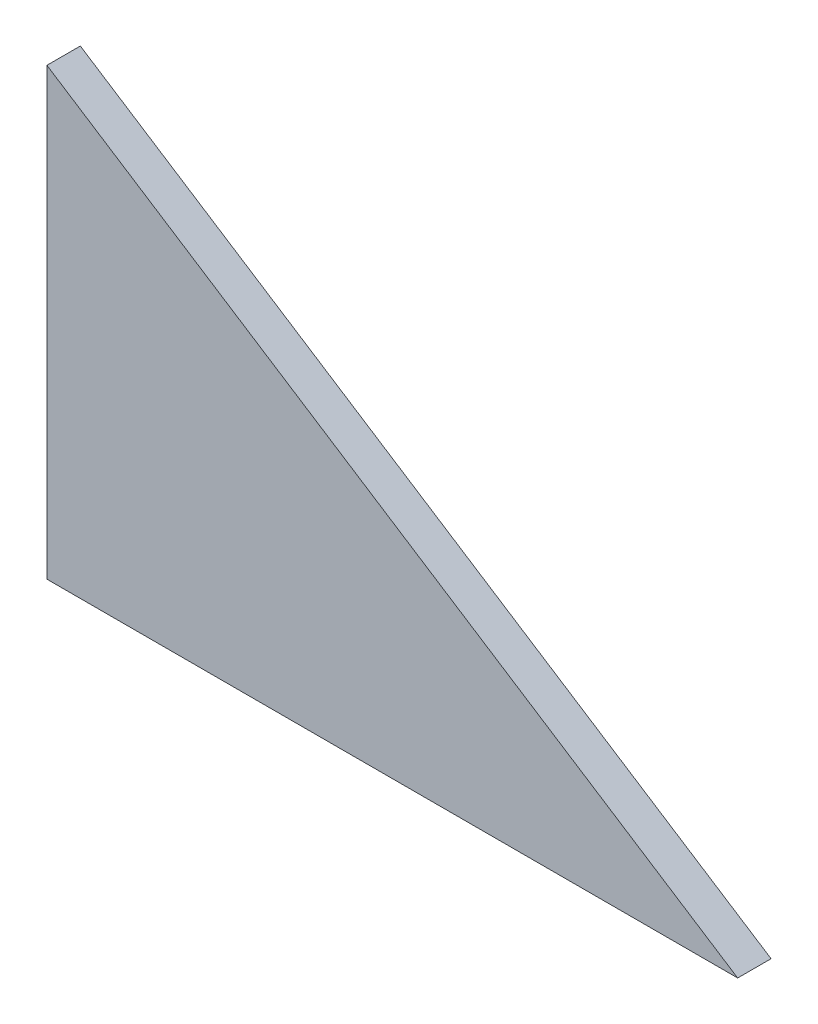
ISO-10303-21;
HEADER;
FILE_DESCRIPTION(('STEP AP214'),'2;1');
FILE_NAME('part.step','',(''),(''),'','','');
FILE_SCHEMA(('AUTOMOTIVE_DESIGN { 1 0 10303 214 1 1 1 1 }'));
ENDSEC;
DATA;
#1=APPLICATION_CONTEXT('core data for automotive mechanical design processes');
#2=APPLICATION_PROTOCOL_DEFINITION('international standard','automotive_design',2000,#1);
#3=PRODUCT_CONTEXT('',#1,'mechanical');
#4=PRODUCT('Part','Part','',(#3));
#5=PRODUCT_RELATED_PRODUCT_CATEGORY('part','',(#4));
#6=PRODUCT_DEFINITION_FORMATION('','',#4);
#7=PRODUCT_DEFINITION_CONTEXT('part definition',#1,'design');
#8=PRODUCT_DEFINITION('design','',#6,#7);
#9=PRODUCT_DEFINITION_SHAPE('','',#8);
#10=(LENGTH_UNIT() NAMED_UNIT(*) SI_UNIT(.MILLI.,.METRE.));
#11=(NAMED_UNIT(*) PLANE_ANGLE_UNIT() SI_UNIT($,.RADIAN.));
#12=(NAMED_UNIT(*) SI_UNIT($,.STERADIAN.) SOLID_ANGLE_UNIT());
#13=UNCERTAINTY_MEASURE_WITH_UNIT(LENGTH_MEASURE(1.E-05),#10,'distance_accuracy_value','');
#14=(GEOMETRIC_REPRESENTATION_CONTEXT(3) GLOBAL_UNCERTAINTY_ASSIGNED_CONTEXT((#13)) GLOBAL_UNIT_ASSIGNED_CONTEXT((#10,
#11,#12)) REPRESENTATION_CONTEXT('',''));
#15=CARTESIAN_POINT('',(0.,0.,0.));
#16=DIRECTION('',(0.,0.,1.));
#17=DIRECTION('',(1.,0.,0.));
#18=AXIS2_PLACEMENT_3D('',#15,#16,#17);
#19=CARTESIAN_POINT('',(-49.842243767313,-29.3897368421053,6.));
#20=DIRECTION('',(1.,0.,0.));
#21=DIRECTION('',(0.,0.,-1.));
#22=AXIS2_PLACEMENT_3D('',#19,#20,#21);
#23=PLANE('',#22);
#24=DIRECTION('',(0.,-1.,0.));
#25=VECTOR('',#24,1.);
#26=CARTESIAN_POINT('',(-49.842243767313,-29.3897368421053,0.));
#27=LINE('',#26,#25);
#28=CARTESIAN_POINT('',(-49.842243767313,50.5602631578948,0.));
#29=VERTEX_POINT('',#28);
#30=CARTESIAN_POINT('',(-49.842243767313,-29.3897368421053,0.));
#31=VERTEX_POINT('',#30);
#32=EDGE_CURVE('E80',#29,#31,#27,.T.);
#33=ORIENTED_EDGE('',*,*,#32,.T.);
#34=DIRECTION('',(0.,0.,-1.));
#35=VECTOR('',#34,1.);
#36=CARTESIAN_POINT('',(-49.842243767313,-29.3897368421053,6.));
#37=LINE('',#36,#35);
#38=CARTESIAN_POINT('',(-49.842243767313,-29.3897368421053,6.));
#39=VERTEX_POINT('',#38);
#40=EDGE_CURVE('E11',#39,#31,#37,.T.);
#41=ORIENTED_EDGE('',*,*,#40,.F.);
#42=DIRECTION('',(0.,-1.,0.));
#43=VECTOR('',#42,1.);
#44=CARTESIAN_POINT('',(-49.842243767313,-29.3897368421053,6.));
#45=LINE('',#44,#43);
#46=CARTESIAN_POINT('',(-49.842243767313,50.5602631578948,6.));
#47=VERTEX_POINT('',#46);
#48=EDGE_CURVE('E73',#47,#39,#45,.T.);
#49=ORIENTED_EDGE('',*,*,#48,.F.);
#50=DIRECTION('',(0.,0.,-1.));
#51=VECTOR('',#50,1.);
#52=CARTESIAN_POINT('',(-49.842243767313,50.5602631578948,6.));
#53=LINE('',#52,#51);
#54=EDGE_CURVE('E81',#47,#29,#53,.T.);
#55=ORIENTED_EDGE('',*,*,#54,.T.);
#56=EDGE_LOOP('',(#33,#41,#49,#55));
#57=FACE_BOUND('',#56,.T.);
#58=ADVANCED_FACE('F33',(#57),#23,.F.);
#59=CARTESIAN_POINT('',(-49.842243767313,-29.3897368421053,6.));
#60=DIRECTION('',(0.,1.,0.));
#61=DIRECTION('',(0.,0.,1.));
#62=AXIS2_PLACEMENT_3D('',#59,#60,#61);
#63=PLANE('',#62);
#64=DIRECTION('',(1.,0.,0.));
#65=VECTOR('',#64,1.);
#66=CARTESIAN_POINT('',(-49.842243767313,-29.3897368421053,0.));
#67=LINE('',#66,#65);
#68=CARTESIAN_POINT('',(74.247756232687,-29.3897368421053,0.));
#69=VERTEX_POINT('',#68);
#70=EDGE_CURVE('E61',#31,#69,#67,.T.);
#71=ORIENTED_EDGE('',*,*,#70,.T.);
#72=DIRECTION('',(0.,0.,-1.));
#73=VECTOR('',#72,1.);
#74=CARTESIAN_POINT('',(74.247756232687,-29.3897368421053,6.));
#75=LINE('',#74,#73);
#76=CARTESIAN_POINT('',(74.247756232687,-29.3897368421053,6.));
#77=VERTEX_POINT('',#76);
#78=EDGE_CURVE('E41',#77,#69,#75,.T.);
#79=ORIENTED_EDGE('',*,*,#78,.F.);
#80=DIRECTION('',(1.,0.,0.));
#81=VECTOR('',#80,1.);
#82=CARTESIAN_POINT('',(-49.842243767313,-29.3897368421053,6.));
#83=LINE('',#82,#81);
#84=EDGE_CURVE('E69',#39,#77,#83,.T.);
#85=ORIENTED_EDGE('',*,*,#84,.F.);
#86=ORIENTED_EDGE('',*,*,#40,.T.);
#87=EDGE_LOOP('',(#71,#79,#85,#86));
#88=FACE_BOUND('',#87,.T.);
#89=ADVANCED_FACE('F70',(#88),#63,.F.);
#90=CARTESIAN_POINT('',(-49.842243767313,50.5602631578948,6.));
#91=DIRECTION('',(-0.54160985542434,-0.840629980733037,0.));
#92=DIRECTION('',(0.840629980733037,-0.54160985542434,0.));
#93=AXIS2_PLACEMENT_3D('',#90,#91,#92);
#94=PLANE('',#93);
#95=DIRECTION('',(-0.840629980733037,0.54160985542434,0.));
#96=VECTOR('',#95,1.);
#97=CARTESIAN_POINT('',(-49.842243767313,50.5602631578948,0.));
#98=LINE('',#97,#96);
#99=EDGE_CURVE('E66',#69,#29,#98,.T.);
#100=ORIENTED_EDGE('',*,*,#99,.T.);
#101=ORIENTED_EDGE('',*,*,#54,.F.);
#102=DIRECTION('',(-0.840629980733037,0.54160985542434,0.));
#103=VECTOR('',#102,1.);
#104=CARTESIAN_POINT('',(-49.842243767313,50.5602631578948,6.));
#105=LINE('',#104,#103);
#106=EDGE_CURVE('E49',#77,#47,#105,.T.);
#107=ORIENTED_EDGE('',*,*,#106,.F.);
#108=ORIENTED_EDGE('',*,*,#78,.T.);
#109=EDGE_LOOP('',(#100,#101,#107,#108));
#110=FACE_BOUND('',#109,.T.);
#111=ADVANCED_FACE('F88',(#110),#94,.F.);
#112=CARTESIAN_POINT('',(0.,0.,6.));
#113=DIRECTION('',(0.,0.,-1.));
#114=DIRECTION('',(-1.,0.,0.));
#115=AXIS2_PLACEMENT_3D('',#112,#113,#114);
#116=PLANE('',#115);
#117=ORIENTED_EDGE('',*,*,#48,.T.);
#118=ORIENTED_EDGE('',*,*,#84,.T.);
#119=ORIENTED_EDGE('',*,*,#106,.T.);
#120=EDGE_LOOP('',(#117,#118,#119));
#121=FACE_BOUND('',#120,.T.);
#122=ADVANCED_FACE('F76',(#121),#116,.F.);
#123=CARTESIAN_POINT('',(0.,0.,0.));
#124=DIRECTION('',(0.,0.,-1.));
#125=DIRECTION('',(-1.,0.,0.));
#126=AXIS2_PLACEMENT_3D('',#123,#124,#125);
#127=PLANE('',#126);
#128=ORIENTED_EDGE('',*,*,#32,.F.);
#129=ORIENTED_EDGE('',*,*,#99,.F.);
#130=ORIENTED_EDGE('',*,*,#70,.F.);
#131=EDGE_LOOP('',(#128,#129,#130));
#132=FACE_BOUND('',#131,.T.);
#133=ADVANCED_FACE('F89',(#132),#127,.T.);
#134=CLOSED_SHELL('',(#58,#89,#111,#122,#133));
#135=MANIFOLD_SOLID_BREP('B2',#134);
#136=ADVANCED_BREP_SHAPE_REPRESENTATION('',(#18,#135),#14);
#137=SHAPE_DEFINITION_REPRESENTATION(#9,#136);
ENDSEC;
END-ISO-10303-21;
